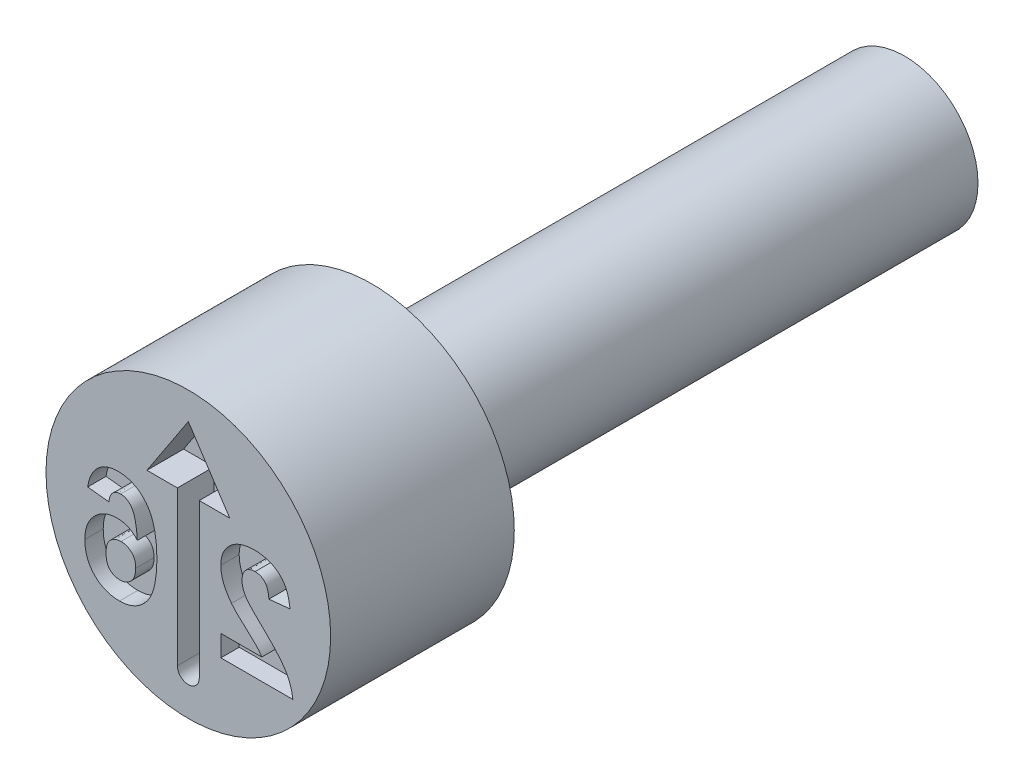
from build123d import *

# Parameters (mm, degrees)
CUT_EXTRUDE4_DEPTH = 0.4
CUT_EXTRUDE5_DEPTH = 0.2


with BuildPart() as part:
    # Sketch2 → Revolve1 (revolve)
    with BuildSketch(Plane(origin=(0, 0, 0), x_dir=(0, 0, -1), z_dir=(1, 0, 0)), mode=Mode.PRIVATE) as revolve1_sk:
        Polygon((0, 1.55), (0, 0), (7.8, 0), (7.8, 0.8), (2, 0.8), (2, 1.55), align=None)
    revolve(revolve1_sk.sketch.rotate(Axis((0, 0, -0.403888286), (0, 0, -1)), 90), axis=Axis((0, 0, -0.403888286), (0, 0, -1)))

    # Sketch3 → Cut-Extrude4 (cut)
    with BuildSketch(Plane.XY):
        with BuildLine():
            Line((0.119045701, 0.566469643), (0.119045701, -1.110101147))
            ThreePointArc((0.119045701, -1.110101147), (0, -1.229146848), (-0.119045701, -1.110101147))
            Line((-0.119045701, -1.110101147), (-0.119045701, 0.566469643))
            Line((-0.119045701, 0.566469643), (-0.451198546, 0.566469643))
            Line((-0.451198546, 0.566469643), (0, 1.251322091))
            Line((0, 1.251322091), (0.451198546, 0.566469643))
            Line((0.451198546, 0.566469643), (0.119045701, 0.566469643))
        make_face()
    extrude(amount=-CUT_EXTRUDE4_DEPTH, mode=Mode.SUBTRACT)

    # Sketch4 → Cut-Extrude5 (cut)
    # profile 1 of 2: a face of its own
    with BuildSketch(Plane.XY):
        with BuildLine():
            Line((0.353846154, -0.569230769), (0.353846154, -0.8))
            Line((0.353846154, -0.8), (1.138461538, -0.8))
            add(Edge.make_bspline(
                [(1.138461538, -0.8), (1.135805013, -0.780277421), (1.13049345, -0.740843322), (1.114071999, -0.683240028), (1.092154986, -0.627029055), (1.068368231, -0.581286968), (1.044709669, -0.544466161), (1.023244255, -0.514294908), (0.997636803, -0.482193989), (0.968258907, -0.447904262), (0.935272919, -0.411318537), (0.898432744, -0.372572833), (0.857562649, -0.331852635), (0.828809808, -0.304201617), (0.813942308, -0.289903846)],
                knots=[0, 0, 0, 0, 1.156289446, 2.311930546, 3.473459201, 4.661751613, 5.303057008, 6.018253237, 6.81459331, 7.690699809, 8.644447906, 9.679642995, 10.800191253, 12, 12, 12, 12], degree=3))
            add(Edge.make_bspline(
                [(0.813942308, -0.289903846), (0.802077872, -0.278451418), (0.779491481, -0.256649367), (0.747328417, -0.225429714), (0.719053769, -0.196729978), (0.694076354, -0.171293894), (0.672973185, -0.148473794), (0.65546667, -0.128628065), (0.641335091, -0.111675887), (0.633681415, -0.100921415), (0.630288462, -0.096153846)],
                knots=[0, 0, 0, 0, 1.480720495, 2.818855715, 4.024636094, 5.098235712, 6.019786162, 6.815086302, 7.474715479, 8, 8, 8, 8], degree=3))
            add(Edge.make_bspline(
                [(0.630288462, -0.096153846), (0.623340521, -0.084612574), (0.609938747, -0.062350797), (0.595242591, -0.02734375), (0.58642141, 0.007656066), (0.585210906, 0.031042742), (0.584615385, 0.042548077)],
                knots=[0, 0, 0, 0, 1.0911822, 2.104764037, 3.067617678, 4, 4, 4, 4], degree=3))
            add(Edge.make_bspline(
                [(0.584615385, 0.042548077), (0.585047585, 0.054520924), (0.585865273, 0.077172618), (0.592721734, 0.109138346), (0.604880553, 0.136617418), (0.621621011, 0.159694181), (0.642789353, 0.177774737), (0.66753576, 0.191134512), (0.69622248, 0.198520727), (0.716385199, 0.199492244), (0.726923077, 0.2)],
                knots=[0, 0, 0, 0, 1.193122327, 2.257294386, 3.237245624, 4.168877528, 5.075331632, 5.990371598, 6.949684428, 8, 8, 8, 8], degree=3))
            add(Edge.make_bspline(
                [(0.726923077, 0.2), (0.737389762, 0.199525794), (0.757609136, 0.198609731), (0.786345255, 0.190607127), (0.811484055, 0.176753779), (0.829399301, 0.160966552), (0.8415019, 0.14561462), (0.849748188, 0.132236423), (0.856855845, 0.117034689), (0.863153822, 0.100180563), (0.868128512, 0.081480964), (0.872134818, 0.061078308), (0.875363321, 0.0388628), (0.876390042, 0.023408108), (0.876923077, 0.015384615)],
                knots=[0, 0, 0, 0, 1.402788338, 2.709884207, 3.961032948, 5.225417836, 5.883680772, 6.578928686, 7.329201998, 8.132101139, 8.990263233, 9.922304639, 10.921339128, 12, 12, 12, 12], degree=3))
            Line((0.876923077, 0.015384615), (1.107692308, 0.037980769))
            add(Edge.make_bspline(
                [(1.107692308, 0.037980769), (1.105836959, 0.053560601), (1.102239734, 0.083767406), (1.093262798, 0.127154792), (1.081893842, 0.167181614), (1.067590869, 0.20377359), (1.050945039, 0.237163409), (1.031107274, 0.266850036), (1.008770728, 0.293162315), (0.983916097, 0.316086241), (0.95670139, 0.335694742), (0.928144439, 0.353198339), (0.897687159, 0.367556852), (0.865664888, 0.379390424), (0.832092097, 0.38884772), (0.796813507, 0.395100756), (0.760046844, 0.399499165), (0.734949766, 0.399830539), (0.722115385, 0.4)],
                knots=[0, 0, 0, 0, 1.270971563, 2.464210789, 3.586263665, 4.638946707, 5.643716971, 6.603612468, 7.52484387, 8.434700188, 9.336036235, 10.239171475, 11.145359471, 12.059630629, 13.003312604, 13.96741569, 14.960557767, 16, 16, 16, 16], degree=3))
            add(Edge.make_bspline(
                [(0.722115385, 0.4), (0.708162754, 0.399731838), (0.680988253, 0.399209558), (0.641318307, 0.394896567), (0.604051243, 0.387376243), (0.568861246, 0.37741451), (0.536109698, 0.364114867), (0.505523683, 0.348036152), (0.47758457, 0.328568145), (0.451875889, 0.30677252), (0.428894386, 0.282804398), (0.408764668, 0.257238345), (0.391900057, 0.230092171), (0.377748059, 0.201696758), (0.367240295, 0.171595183), (0.359583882, 0.140203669), (0.354507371, 0.107375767), (0.354068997, 0.084955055), (0.353846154, 0.073557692)],
                knots=[0, 0, 0, 0, 1.210756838, 2.35810096, 3.457354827, 4.507168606, 5.527358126, 6.519769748, 7.499700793, 8.476517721, 9.440526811, 10.376769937, 11.295256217, 12.209626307, 13.124630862, 14.055668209, 15.011616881, 16, 16, 16, 16], degree=3))
            add(Edge.make_bspline(
                [(0.353846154, 0.073557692), (0.354139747, 0.060477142), (0.354722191, 0.034527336), (0.36029866, -0.003834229), (0.368818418, -0.041311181), (0.38140995, -0.07799511), (0.397370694, -0.114765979), (0.417944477, -0.151706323), (0.441832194, -0.189930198), (0.460535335, -0.214643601), (0.470192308, -0.227403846)],
                knots=[0, 0, 0, 0, 0.953409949, 1.89141903, 2.821310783, 3.752688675, 4.715703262, 5.740811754, 6.833515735, 8, 8, 8, 8], degree=3))
            add(Edge.make_bspline(
                [(0.470192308, -0.227403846), (0.473842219, -0.232000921), (0.481659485, -0.241846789), (0.494958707, -0.256943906), (0.510371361, -0.273434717), (0.527679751, -0.291627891), (0.547455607, -0.310879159), (0.568987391, -0.331993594), (0.593222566, -0.353891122), (0.618324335, -0.377117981), (0.643535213, -0.399724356), (0.666707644, -0.4211954), (0.687755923, -0.440192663), (0.70569979, -0.45776488), (0.7215947, -0.472712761), (0.734867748, -0.485802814), (0.745767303, -0.496718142), (0.760786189, -0.513732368), (0.779896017, -0.536744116), (0.793340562, -0.558732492), (0.799759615, -0.569230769)],
                knots=[0, 0, 0, 0, 0.665555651, 1.425465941, 2.280616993, 3.225313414, 4.272635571, 5.410053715, 6.644756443, 7.976022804, 9.288331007, 10.484517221, 11.558462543, 12.503158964, 13.33222979, 14.032602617, 14.617328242, 15.080653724, 16.606167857, 18, 18, 18, 18], degree=3))
            Line((0.799759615, -0.569230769), (0.353846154, -0.569230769))
        make_face()
    # profile 2 of 2: a face of its own
    with BuildSketch(Plane.XY):
        with BuildLine():
            Line((-1.096, 0.086778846), (-0.865230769, 0.061538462))
            add(Edge.make_bspline(
                [(-0.865230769, 0.061538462), (-0.863684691, 0.072653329), (-0.860775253, 0.093569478), (-0.852157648, 0.122433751), (-0.840160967, 0.146715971), (-0.824762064, 0.16645009), (-0.806420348, 0.181638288), (-0.785520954, 0.192430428), (-0.762077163, 0.198836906), (-0.745640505, 0.199602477), (-0.737105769, 0.2)],
                knots=[0, 0, 0, 0, 1.280716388, 2.410074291, 3.425374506, 4.35753932, 5.248331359, 6.12451615, 7.026154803, 8, 8, 8, 8], degree=3))
            add(Edge.make_bspline(
                [(-0.737105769, 0.2), (-0.731318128, 0.19985848), (-0.719801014, 0.199576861), (-0.703024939, 0.196001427), (-0.686850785, 0.19069546), (-0.671410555, 0.183180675), (-0.656627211, 0.17348424), (-0.642725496, 0.161490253), (-0.62906629, 0.147830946), (-0.616453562, 0.131336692), (-0.604353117, 0.111806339), (-0.593934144, 0.087897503), (-0.584647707, 0.059632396), (-0.57669653, 0.026872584), (-0.569480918, -0.010173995), (-0.563566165, -0.05165731), (-0.558833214, -0.097614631), (-0.556562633, -0.129799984), (-0.555375, -0.146634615)],
                knots=[0, 0, 0, 0, 0.642458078, 1.278459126, 1.898279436, 2.531842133, 3.181731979, 3.858193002, 4.57010051, 5.325711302, 6.161524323, 7.118599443, 8.217371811, 9.466325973, 10.864147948, 12.412648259, 14.123626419, 16, 16, 16, 16], degree=3))
            add(Edge.make_bspline(
                [(-0.555375, -0.146634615), (-0.562750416, -0.138623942), (-0.577212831, -0.122915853), (-0.601210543, -0.102436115), (-0.626351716, -0.084927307), (-0.652909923, -0.07056288), (-0.681030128, -0.05987329), (-0.710202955, -0.05175689), (-0.740810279, -0.047210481), (-0.761610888, -0.046510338), (-0.772201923, -0.046153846)],
                knots=[0, 0, 0, 0, 1.057745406, 2.074127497, 3.059409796, 4.031705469, 5.000875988, 5.977809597, 6.970362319, 8, 8, 8, 8], degree=3))
            add(Edge.make_bspline(
                [(-0.772201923, -0.046153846), (-0.784154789, -0.046498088), (-0.807757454, -0.047177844), (-0.84252966, -0.05194551), (-0.875895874, -0.06051863), (-0.908007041, -0.072115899), (-0.939021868, -0.086719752), (-0.968347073, -0.105206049), (-0.996442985, -0.126760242), (-1.022923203, -0.151385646), (-1.047252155, -0.178496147), (-1.068732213, -0.207777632), (-1.086409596, -0.239319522), (-1.10152164, -0.272415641), (-1.112765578, -0.307719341), (-1.120927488, -0.344722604), (-1.125799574, -0.38376509), (-1.126440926, -0.410402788), (-1.126769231, -0.424038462)],
                knots=[0, 0, 0, 0, 0.99135015, 1.957564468, 2.903754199, 3.843479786, 4.78583385, 5.741106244, 6.712813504, 7.719198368, 8.735844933, 9.730198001, 10.724351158, 11.729813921, 12.742848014, 13.790983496, 14.86921809, 16, 16, 16, 16], degree=3))
            add(Edge.make_bspline(
                [(-1.126769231, -0.424038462), (-1.126436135, -0.438473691), (-1.125786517, -0.466625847), (-1.121004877, -0.507855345), (-1.11255847, -0.54677135), (-1.101018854, -0.583686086), (-1.086092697, -0.618307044), (-1.068010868, -0.650919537), (-1.046161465, -0.680966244), (-1.021536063, -0.708851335), (-0.994083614, -0.73373517), (-0.964827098, -0.755770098), (-0.93344202, -0.774087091), (-0.900392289, -0.789503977), (-0.865110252, -0.800817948), (-0.828217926, -0.809302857), (-0.789415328, -0.814477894), (-0.762923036, -0.815077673), (-0.749365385, -0.815384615)],
                knots=[0, 0, 0, 0, 1.13287417, 2.209376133, 3.25169942, 4.254157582, 5.240146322, 6.205890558, 7.174579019, 8.150183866, 9.1206468, 10.07783463, 11.019441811, 11.967766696, 12.934309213, 13.921380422, 14.936249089, 16, 16, 16, 16], degree=3))
            add(Edge.make_bspline(
                [(-0.749365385, -0.815384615), (-0.734838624, -0.814978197), (-0.706276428, -0.814179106), (-0.664464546, -0.807602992), (-0.624713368, -0.796477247), (-0.587027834, -0.78093967), (-0.551094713, -0.761395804), (-0.51724767, -0.737118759), (-0.485576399, -0.708340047), (-0.455661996, -0.675449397), (-0.428440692, -0.637458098), (-0.405258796, -0.593548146), (-0.385598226, -0.544200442), (-0.369591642, -0.489288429), (-0.357235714, -0.428816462), (-0.348614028, -0.36277947), (-0.342887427, -0.291286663), (-0.342404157, -0.241758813), (-0.342153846, -0.216105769)],
                knots=[0, 0, 0, 0, 0.852151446, 1.675481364, 2.476404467, 3.269281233, 4.062617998, 4.871616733, 5.707301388, 6.56955125, 7.476395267, 8.442009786, 9.475854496, 10.58877921, 11.794095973, 13.094195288, 14.494932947, 16, 16, 16, 16], degree=3))
            add(Edge.make_bspline(
                [(-0.342153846, -0.216105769), (-0.342512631, -0.189813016), (-0.343205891, -0.139009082), (-0.348784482, -0.065655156), (-0.357645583, 0.002084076), (-0.370553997, 0.06405586), (-0.387064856, 0.120388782), (-0.407081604, 0.171196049), (-0.431107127, 0.216293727), (-0.459040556, 0.255535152), (-0.489775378, 0.289646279), (-0.522800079, 0.319089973), (-0.557988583, 0.344150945), (-0.595340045, 0.364765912), (-0.635161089, 0.380394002), (-0.677074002, 0.391679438), (-0.721149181, 0.398932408), (-0.751339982, 0.39964042), (-0.766673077, 0.4)],
                knots=[0, 0, 0, 0, 1.491699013, 2.882321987, 4.171520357, 5.365488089, 6.470299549, 7.49861535, 8.458736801, 9.361983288, 10.224742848, 11.058789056, 11.867429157, 12.671146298, 13.473202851, 14.288259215, 15.130652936, 16, 16, 16, 16], degree=3))
            add(Edge.make_bspline(
                [(-0.766673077, 0.4), (-0.777503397, 0.399805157), (-0.798675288, 0.399424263), (-0.829705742, 0.395379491), (-0.859308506, 0.389194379), (-0.887561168, 0.380632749), (-0.914264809, 0.369167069), (-0.93952547, 0.355199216), (-0.963428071, 0.33876702), (-0.985848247, 0.319976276), (-1.006605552, 0.298770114), (-1.025348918, 0.275100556), (-1.042202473, 0.249253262), (-1.057239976, 0.221249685), (-1.069853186, 0.190821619), (-1.080696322, 0.158208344), (-1.089614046, 0.123339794), (-1.093838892, 0.099151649), (-1.096, 0.086778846)],
                knots=[0, 0, 0, 0, 1.036027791, 2.025301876, 2.989435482, 3.928225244, 4.845595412, 5.765526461, 6.686607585, 7.61747015, 8.561102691, 9.521661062, 10.50224679, 11.510949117, 12.559251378, 13.650572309, 14.798212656, 16, 16, 16, 16], degree=3))
        make_face()
        with BuildLine():
            add(Edge.make_bspline(
                [(-0.572923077, -0.41875), (-0.573010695, -0.42637143), (-0.573181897, -0.441263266), (-0.575989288, -0.462872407), (-0.58002467, -0.483130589), (-0.585460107, -0.502150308), (-0.592993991, -0.51964371), (-0.601932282, -0.535961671), (-0.612505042, -0.550956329), (-0.628727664, -0.568549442), (-0.651144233, -0.587027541), (-0.680562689, -0.603482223), (-0.712083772, -0.613710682), (-0.733825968, -0.614823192), (-0.744798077, -0.615384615)],
                knots=[0, 0, 0, 0, 0.93816693, 1.833124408, 2.679057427, 3.481731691, 4.264557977, 5.020023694, 5.770442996, 6.518065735, 7.962605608, 9.32780964, 10.651490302, 12, 12, 12, 12], degree=3))
            add(Edge.make_bspline(
                [(-0.744798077, -0.615384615), (-0.75519203, -0.614918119), (-0.775422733, -0.614010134), (-0.804312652, -0.605711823), (-0.830554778, -0.592624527), (-0.849792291, -0.577259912), (-0.863206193, -0.562315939), (-0.872220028, -0.549210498), (-0.879557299, -0.534260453), (-0.885555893, -0.517712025), (-0.890387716, -0.499629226), (-0.893686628, -0.479830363), (-0.895557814, -0.458369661), (-0.895849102, -0.443513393), (-0.896, -0.435817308)],
                knots=[0, 0, 0, 0, 1.399678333, 2.724321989, 4.020062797, 5.33532049, 6.016755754, 6.724441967, 7.473839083, 8.257094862, 9.096253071, 9.995581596, 10.961638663, 12, 12, 12, 12], degree=3))
            add(Edge.make_bspline(
                [(-0.896, -0.435817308), (-0.895871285, -0.427879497), (-0.895622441, -0.412533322), (-0.893444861, -0.390352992), (-0.889882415, -0.369848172), (-0.884901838, -0.350873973), (-0.878160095, -0.333684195), (-0.870206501, -0.31793212), (-0.860550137, -0.304044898), (-0.846199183, -0.287711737), (-0.825332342, -0.271253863), (-0.797450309, -0.256263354), (-0.766197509, -0.247765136), (-0.744446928, -0.246701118), (-0.733259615, -0.246153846)],
                knots=[0, 0, 0, 0, 1.008384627, 1.949510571, 2.828269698, 3.650667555, 4.437180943, 5.170285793, 5.887596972, 6.580056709, 7.926803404, 9.238379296, 10.579573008, 12, 12, 12, 12], degree=3))
            add(Edge.make_bspline(
                [(-0.733259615, -0.246153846), (-0.722382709, -0.246596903), (-0.70125805, -0.24745739), (-0.670899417, -0.256098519), (-0.643120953, -0.269848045), (-0.622660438, -0.286000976), (-0.608239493, -0.301224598), (-0.5987944, -0.314186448), (-0.59057291, -0.328298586), (-0.584080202, -0.343925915), (-0.579074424, -0.360775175), (-0.575484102, -0.378961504), (-0.573311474, -0.398424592), (-0.573054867, -0.411853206), (-0.572923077, -0.41875)],
                knots=[0, 0, 0, 0, 1.469034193, 2.853094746, 4.235454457, 5.641396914, 6.354997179, 7.06867986, 7.807229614, 8.560602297, 9.353235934, 10.182779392, 11.06669468, 12, 12, 12, 12], degree=3))
        make_face(mode=Mode.SUBTRACT)
    extrude(amount=-CUT_EXTRUDE5_DEPTH, mode=Mode.SUBTRACT)


solid = part.part
